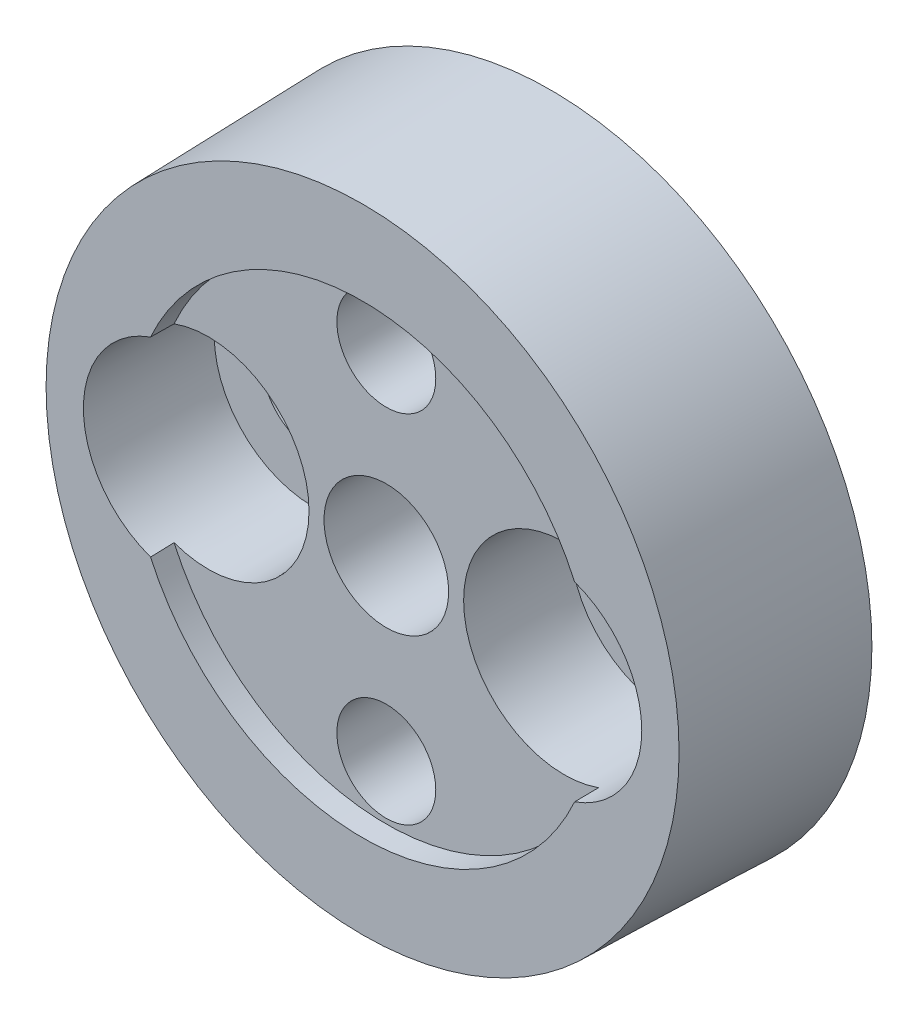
ISO-10303-21;
HEADER;
FILE_DESCRIPTION(('STEP AP214'),'2;1');
FILE_NAME('part.step','',(''),(''),'','','');
FILE_SCHEMA(('AUTOMOTIVE_DESIGN { 1 0 10303 214 1 1 1 1 }'));
ENDSEC;
DATA;
#1=APPLICATION_CONTEXT('core data for automotive mechanical design processes');
#2=APPLICATION_PROTOCOL_DEFINITION('international standard','automotive_design',2000,#1);
#3=PRODUCT_CONTEXT('',#1,'mechanical');
#4=PRODUCT('Part','Part','',(#3));
#5=PRODUCT_RELATED_PRODUCT_CATEGORY('part','',(#4));
#6=PRODUCT_DEFINITION_FORMATION('','',#4);
#7=PRODUCT_DEFINITION_CONTEXT('part definition',#1,'design');
#8=PRODUCT_DEFINITION('design','',#6,#7);
#9=PRODUCT_DEFINITION_SHAPE('','',#8);
#10=(LENGTH_UNIT() NAMED_UNIT(*) SI_UNIT(.MILLI.,.METRE.));
#11=(NAMED_UNIT(*) PLANE_ANGLE_UNIT() SI_UNIT($,.RADIAN.));
#12=(NAMED_UNIT(*) SI_UNIT($,.STERADIAN.) SOLID_ANGLE_UNIT());
#13=UNCERTAINTY_MEASURE_WITH_UNIT(LENGTH_MEASURE(1.E-05),#10,'distance_accuracy_value','');
#14=(GEOMETRIC_REPRESENTATION_CONTEXT(3) GLOBAL_UNCERTAINTY_ASSIGNED_CONTEXT((#13)) GLOBAL_UNIT_ASSIGNED_CONTEXT((#10,
#11,#12)) REPRESENTATION_CONTEXT('',''));
#15=CARTESIAN_POINT('',(0.,0.,0.));
#16=DIRECTION('',(0.,0.,1.));
#17=DIRECTION('',(1.,0.,0.));
#18=AXIS2_PLACEMENT_3D('',#15,#16,#17);
#19=CARTESIAN_POINT('',(0.,0.,9.5));
#20=DIRECTION('',(0.,0.,1.));
#21=DIRECTION('',(1.,0.,0.));
#22=AXIS2_PLACEMENT_3D('',#19,#20,#21);
#23=CYLINDRICAL_SURFACE('',#22,11.75);
#24=CARTESIAN_POINT('',(0.,0.,9.5));
#25=DIRECTION('',(0.,0.,1.));
#26=DIRECTION('',(1.,0.,0.));
#27=AXIS2_PLACEMENT_3D('',#24,#25,#26);
#28=CIRCLE('',#27,11.75);
#29=CARTESIAN_POINT('',(-10.7175026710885,-4.81639247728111,9.5));
#30=VERTEX_POINT('',#29);
#31=CARTESIAN_POINT('',(10.7175026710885,-4.8163924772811,9.5));
#32=VERTEX_POINT('',#31);
#33=EDGE_CURVE('E59',#30,#32,#28,.T.);
#34=ORIENTED_EDGE('',*,*,#33,.T.);
#35=CARTESIAN_POINT('',(10.7174411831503,-4.81652929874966,9.5062));
#36=CARTESIAN_POINT('',(10.7194451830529,-4.81207013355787,9.30413324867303));
#37=CARTESIAN_POINT('',(10.721447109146,-4.80760812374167,9.10206653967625));
#38=CARTESIAN_POINT('',(10.7254468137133,-4.79867841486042,8.69793320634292));
#39=CARTESIAN_POINT('',(10.7274445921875,-4.79421071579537,8.49586658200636));
#40=CARTESIAN_POINT('',(10.7294402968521,-4.78974017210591,8.2938));
#41=B_SPLINE_CURVE_WITH_KNOTS('',3,(#35,#36,#37,#38,#39,#40),.UNSPECIFIED.,.F.,.F.,(4,2,4),(0.,
0.606377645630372,1.21275529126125),.UNSPECIFIED.);
#42=CARTESIAN_POINT('',(10.7293790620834,-4.78987734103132,8.3));
#43=VERTEX_POINT('',#42);
#44=EDGE_CURVE('E68',#32,#43,#41,.T.);
#45=ORIENTED_EDGE('',*,*,#44,.T.);
#46=CARTESIAN_POINT('',(0.,0.,8.3));
#47=DIRECTION('',(0.,0.,1.));
#48=DIRECTION('',(1.,0.,0.));
#49=AXIS2_PLACEMENT_3D('',#46,#47,#48);
#50=CIRCLE('',#49,11.75);
#51=CARTESIAN_POINT('',(-10.7293790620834,-4.78987734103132,8.3));
#52=VERTEX_POINT('',#51);
#53=EDGE_CURVE('E58',#52,#43,#50,.T.);
#54=ORIENTED_EDGE('',*,*,#53,.F.);
#55=CARTESIAN_POINT('',(-10.7294402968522,-4.78974017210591,8.2938));
#56=CARTESIAN_POINT('',(-10.7274445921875,-4.79421071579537,8.49586658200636));
#57=CARTESIAN_POINT('',(-10.7254468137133,-4.79867841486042,8.69793320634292));
#58=CARTESIAN_POINT('',(-10.721447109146,-4.80760812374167,9.10206653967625));
#59=CARTESIAN_POINT('',(-10.7194451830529,-4.81207013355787,9.30413324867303));
#60=CARTESIAN_POINT('',(-10.7174411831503,-4.81652929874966,9.5062));
#61=B_SPLINE_CURVE_WITH_KNOTS('',3,(#55,#56,#57,#58,#59,#60),.UNSPECIFIED.,.F.,.F.,(4,2,4),(0.,
0.606377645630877,1.21275529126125),.UNSPECIFIED.);
#62=EDGE_CURVE('E115',#52,#30,#61,.T.);
#63=ORIENTED_EDGE('',*,*,#62,.T.);
#64=EDGE_LOOP('',(#34,#45,#54,#63));
#65=FACE_BOUND('',#64,.T.);
#66=ADVANCED_FACE('F14',(#65),#23,.F.);
#67=CARTESIAN_POINT('',(10.7175026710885,4.8163924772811,9.5));
#68=VERTEX_POINT('',#67);
#69=CARTESIAN_POINT('',(-10.7175026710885,4.81639247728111,9.5));
#70=VERTEX_POINT('',#69);
#71=EDGE_CURVE('E51',#68,#70,#28,.T.);
#72=ORIENTED_EDGE('',*,*,#71,.T.);
#73=CARTESIAN_POINT('',(-10.7174411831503,4.81652929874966,9.5062));
#74=CARTESIAN_POINT('',(-10.7194451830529,4.81207013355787,9.30413324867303));
#75=CARTESIAN_POINT('',(-10.721447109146,4.80760812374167,9.10206653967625));
#76=CARTESIAN_POINT('',(-10.7254468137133,4.79867841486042,8.69793320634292));
#77=CARTESIAN_POINT('',(-10.7274445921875,4.79421071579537,8.49586658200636));
#78=CARTESIAN_POINT('',(-10.7294402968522,4.78974017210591,8.2938));
#79=B_SPLINE_CURVE_WITH_KNOTS('',3,(#73,#74,#75,#76,#77,#78),.UNSPECIFIED.,.F.,.F.,(4,2,4),(0.,
0.606377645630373,1.21275529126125),.UNSPECIFIED.);
#80=CARTESIAN_POINT('',(-10.7293790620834,4.78987734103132,8.3));
#81=VERTEX_POINT('',#80);
#82=EDGE_CURVE('E29',#70,#81,#79,.T.);
#83=ORIENTED_EDGE('',*,*,#82,.T.);
#84=CARTESIAN_POINT('',(10.7293790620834,4.78987734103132,8.3));
#85=VERTEX_POINT('',#84);
#86=EDGE_CURVE('E72',#85,#81,#50,.T.);
#87=ORIENTED_EDGE('',*,*,#86,.F.);
#88=CARTESIAN_POINT('',(10.7294402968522,4.78974017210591,8.2938));
#89=CARTESIAN_POINT('',(10.7274445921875,4.79421071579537,8.49586658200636));
#90=CARTESIAN_POINT('',(10.7254468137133,4.79867841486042,8.69793320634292));
#91=CARTESIAN_POINT('',(10.721447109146,4.80760812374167,9.10206653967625));
#92=CARTESIAN_POINT('',(10.7194451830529,4.81207013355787,9.30413324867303));
#93=CARTESIAN_POINT('',(10.7174411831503,4.81652929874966,9.5062));
#94=B_SPLINE_CURVE_WITH_KNOTS('',3,(#88,#89,#90,#91,#92,#93),.UNSPECIFIED.,.F.,.F.,(4,2,4),(0.,
0.606377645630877,1.21275529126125),.UNSPECIFIED.);
#95=EDGE_CURVE('E65',#85,#68,#94,.T.);
#96=ORIENTED_EDGE('',*,*,#95,.T.);
#97=EDGE_LOOP('',(#72,#83,#87,#96));
#98=FACE_BOUND('',#97,.T.);
#99=ADVANCED_FACE('F70',(#98),#23,.F.);
#100=CARTESIAN_POINT('',(0.,16.2487662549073,0.));
#101=DIRECTION('',(0.,0.,-1.));
#102=DIRECTION('',(-1.,0.,0.));
#103=AXIS2_PLACEMENT_3D('',#100,#101,#102);
#104=PLANE('',#103);
#105=CARTESIAN_POINT('',(0.,0.,0.));
#106=DIRECTION('',(0.,0.,1.));
#107=DIRECTION('',(1.,0.,0.));
#108=AXIS2_PLACEMENT_3D('',#105,#106,#107);
#109=CIRCLE('',#108,3.15);
#110=CARTESIAN_POINT('',(3.15,0.,0.));
#111=VERTEX_POINT('',#110);
#112=EDGE_CURVE('E144',#111,#111,#109,.T.);
#113=ORIENTED_EDGE('',*,*,#112,.T.);
#114=EDGE_LOOP('',(#113));
#115=FACE_BOUND('',#114,.T.);
#116=CARTESIAN_POINT('',(0.,9.,0.));
#117=DIRECTION('',(0.,0.,1.));
#118=DIRECTION('',(1.,0.,0.));
#119=AXIS2_PLACEMENT_3D('',#116,#117,#118);
#120=CIRCLE('',#119,2.5);
#121=CARTESIAN_POINT('',(2.5,9.,0.));
#122=VERTEX_POINT('',#121);
#123=EDGE_CURVE('E131',#122,#122,#120,.T.);
#124=ORIENTED_EDGE('',*,*,#123,.T.);
#125=EDGE_LOOP('',(#124));
#126=FACE_BOUND('',#125,.T.);
#127=CARTESIAN_POINT('',(9.,0.,0.));
#128=DIRECTION('',(0.,0.,1.));
#129=DIRECTION('',(1.,0.,0.));
#130=AXIS2_PLACEMENT_3D('',#127,#128,#129);
#131=CIRCLE('',#130,2.5);
#132=CARTESIAN_POINT('',(11.5,0.,0.));
#133=VERTEX_POINT('',#132);
#134=EDGE_CURVE('E73',#133,#133,#131,.T.);
#135=ORIENTED_EDGE('',*,*,#134,.T.);
#136=EDGE_LOOP('',(#135));
#137=FACE_BOUND('',#136,.T.);
#138=CARTESIAN_POINT('',(-9.,0.,0.));
#139=DIRECTION('',(0.,0.,1.));
#140=DIRECTION('',(1.,0.,0.));
#141=AXIS2_PLACEMENT_3D('',#138,#139,#140);
#142=CIRCLE('',#141,2.5);
#143=CARTESIAN_POINT('',(-6.5,0.,0.));
#144=VERTEX_POINT('',#143);
#145=EDGE_CURVE('E191',#144,#144,#142,.T.);
#146=ORIENTED_EDGE('',*,*,#145,.T.);
#147=EDGE_LOOP('',(#146));
#148=FACE_BOUND('',#147,.T.);
#149=CARTESIAN_POINT('',(0.,-9.,0.));
#150=DIRECTION('',(0.,0.,1.));
#151=DIRECTION('',(1.,0.,0.));
#152=AXIS2_PLACEMENT_3D('',#149,#150,#151);
#153=CIRCLE('',#152,2.5);
#154=CARTESIAN_POINT('',(2.5,-9.,0.));
#155=VERTEX_POINT('',#154);
#156=EDGE_CURVE('E128',#155,#155,#153,.T.);
#157=ORIENTED_EDGE('',*,*,#156,.T.);
#158=EDGE_LOOP('',(#157));
#159=FACE_BOUND('',#158,.T.);
#160=CARTESIAN_POINT('',(0.,0.,0.));
#161=DIRECTION('',(0.,0.,1.));
#162=DIRECTION('',(1.,0.,0.));
#163=AXIS2_PLACEMENT_3D('',#160,#161,#162);
#164=CIRCLE('',#163,16.2487662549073);
#165=CARTESIAN_POINT('',(16.2487662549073,0.,0.));
#166=VERTEX_POINT('',#165);
#167=EDGE_CURVE('E134',#166,#166,#164,.T.);
#168=ORIENTED_EDGE('',*,*,#167,.F.);
#169=EDGE_LOOP('',(#168));
#170=FACE_BOUND('',#169,.T.);
#171=ADVANCED_FACE('F16',(#115,#126,#137,#148,#159,#170),#104,.T.);
#172=CARTESIAN_POINT('',(0.,0.,9.5));
#173=DIRECTION('',(0.,0.,1.));
#174=DIRECTION('',(1.,0.,0.));
#175=AXIS2_PLACEMENT_3D('',#172,#173,#174);
#176=CYLINDRICAL_SURFACE('',#175,3.15);
#177=CARTESIAN_POINT('',(0.,0.,8.3));
#178=DIRECTION('',(0.,0.,1.));
#179=DIRECTION('',(1.,0.,0.));
#180=AXIS2_PLACEMENT_3D('',#177,#178,#179);
#181=CIRCLE('',#180,3.15);
#182=CARTESIAN_POINT('',(3.15,0.,8.3));
#183=VERTEX_POINT('',#182);
#184=EDGE_CURVE('E141',#183,#183,#181,.T.);
#185=ORIENTED_EDGE('',*,*,#184,.T.);
#186=EDGE_LOOP('',(#185));
#187=FACE_BOUND('',#186,.T.);
#188=ORIENTED_EDGE('',*,*,#112,.F.);
#189=EDGE_LOOP('',(#188));
#190=FACE_BOUND('',#189,.T.);
#191=ADVANCED_FACE('F167',(#187,#190),#176,.F.);
#192=CARTESIAN_POINT('',(0.,3.15,8.3));
#193=DIRECTION('',(0.,0.,1.));
#194=DIRECTION('',(1.,0.,0.));
#195=AXIS2_PLACEMENT_3D('',#192,#193,#194);
#196=PLANE('',#195);
#197=CARTESIAN_POINT('',(9.,0.,8.3));
#198=DIRECTION('',(0.,0.,1.));
#199=DIRECTION('',(1.,0.,0.));
#200=AXIS2_PLACEMENT_3D('',#197,#198,#199);
#201=CIRCLE('',#200,5.09251184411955);
#202=EDGE_CURVE('E75',#43,#85,#201,.F.);
#203=ORIENTED_EDGE('',*,*,#202,.T.);
#204=ORIENTED_EDGE('',*,*,#86,.T.);
#205=CARTESIAN_POINT('',(-9.,0.,8.3));
#206=DIRECTION('',(0.,0.,1.));
#207=DIRECTION('',(1.,0.,0.));
#208=AXIS2_PLACEMENT_3D('',#205,#206,#207);
#209=CIRCLE('',#208,5.09251184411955);
#210=EDGE_CURVE('E34',#81,#52,#209,.F.);
#211=ORIENTED_EDGE('',*,*,#210,.T.);
#212=ORIENTED_EDGE('',*,*,#53,.T.);
#213=EDGE_LOOP('',(#203,#204,#211,#212));
#214=FACE_BOUND('',#213,.T.);
#215=CARTESIAN_POINT('',(0.,9.,8.3));
#216=DIRECTION('',(0.,0.,1.));
#217=DIRECTION('',(1.,0.,0.));
#218=AXIS2_PLACEMENT_3D('',#215,#216,#217);
#219=CIRCLE('',#218,2.5);
#220=CARTESIAN_POINT('',(2.5,9.,8.3));
#221=VERTEX_POINT('',#220);
#222=EDGE_CURVE('E147',#221,#221,#219,.F.);
#223=ORIENTED_EDGE('',*,*,#222,.T.);
#224=EDGE_LOOP('',(#223));
#225=FACE_BOUND('',#224,.T.);
#226=CARTESIAN_POINT('',(0.,-9.,8.3));
#227=DIRECTION('',(0.,0.,1.));
#228=DIRECTION('',(1.,0.,0.));
#229=AXIS2_PLACEMENT_3D('',#226,#227,#228);
#230=CIRCLE('',#229,2.5);
#231=CARTESIAN_POINT('',(2.5,-9.,8.3));
#232=VERTEX_POINT('',#231);
#233=EDGE_CURVE('E150',#232,#232,#230,.F.);
#234=ORIENTED_EDGE('',*,*,#233,.T.);
#235=EDGE_LOOP('',(#234));
#236=FACE_BOUND('',#235,.T.);
#237=ORIENTED_EDGE('',*,*,#184,.F.);
#238=EDGE_LOOP('',(#237));
#239=FACE_BOUND('',#238,.T.);
#240=ADVANCED_FACE('F154',(#214,#225,#236,#239),#196,.T.);
#241=CARTESIAN_POINT('',(0.,11.75,9.5));
#242=DIRECTION('',(0.,0.,1.));
#243=DIRECTION('',(1.,0.,0.));
#244=AXIS2_PLACEMENT_3D('',#241,#242,#243);
#245=PLANE('',#244);
#246=CARTESIAN_POINT('',(0.,0.,9.5));
#247=DIRECTION('',(0.,0.,1.));
#248=DIRECTION('',(1.,0.,0.));
#249=AXIS2_PLACEMENT_3D('',#246,#247,#248);
#250=CIRCLE('',#249,16.);
#251=CARTESIAN_POINT('',(16.,0.,9.5));
#252=VERTEX_POINT('',#251);
#253=EDGE_CURVE('E137',#252,#252,#250,.T.);
#254=ORIENTED_EDGE('',*,*,#253,.T.);
#255=EDGE_LOOP('',(#254));
#256=FACE_BOUND('',#255,.T.);
#257=CARTESIAN_POINT('',(9.,0.,9.5));
#258=DIRECTION('',(0.,0.,1.));
#259=DIRECTION('',(1.,0.,0.));
#260=AXIS2_PLACEMENT_3D('',#257,#258,#259);
#261=CIRCLE('',#260,5.11345792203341);
#262=EDGE_CURVE('E9',#68,#32,#261,.F.);
#263=ORIENTED_EDGE('',*,*,#262,.T.);
#264=ORIENTED_EDGE('',*,*,#33,.F.);
#265=CARTESIAN_POINT('',(-9.,0.,9.5));
#266=DIRECTION('',(0.,0.,1.));
#267=DIRECTION('',(1.,0.,0.));
#268=AXIS2_PLACEMENT_3D('',#265,#266,#267);
#269=CIRCLE('',#268,5.11345792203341);
#270=EDGE_CURVE('E22',#30,#70,#269,.F.);
#271=ORIENTED_EDGE('',*,*,#270,.T.);
#272=ORIENTED_EDGE('',*,*,#71,.F.);
#273=EDGE_LOOP('',(#263,#264,#271,#272));
#274=FACE_BOUND('',#273,.T.);
#275=ADVANCED_FACE('F53',(#256,#274),#245,.T.);
#276=CARTESIAN_POINT('',(0.,0.,9.5));
#277=DIRECTION('',(0.,0.,-1.));
#278=DIRECTION('',(-1.,0.,0.));
#279=AXIS2_PLACEMENT_3D('',#276,#277,#278);
#280=CONICAL_SURFACE('',#279,16.,0.0261799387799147);
#281=ORIENTED_EDGE('',*,*,#167,.T.);
#282=EDGE_LOOP('',(#281));
#283=FACE_BOUND('',#282,.T.);
#284=ORIENTED_EDGE('',*,*,#253,.F.);
#285=EDGE_LOOP('',(#284));
#286=FACE_BOUND('',#285,.T.);
#287=ADVANCED_FACE('F171',(#283,#286),#280,.T.);
#288=CARTESIAN_POINT('',(0.,9.,18.));
#289=DIRECTION('',(0.,0.,1.));
#290=DIRECTION('',(1.,0.,0.));
#291=AXIS2_PLACEMENT_3D('',#288,#289,#290);
#292=CYLINDRICAL_SURFACE('',#291,2.5);
#293=ORIENTED_EDGE('',*,*,#222,.F.);
#294=EDGE_LOOP('',(#293));
#295=FACE_BOUND('',#294,.T.);
#296=ORIENTED_EDGE('',*,*,#123,.F.);
#297=EDGE_LOOP('',(#296));
#298=FACE_BOUND('',#297,.T.);
#299=ADVANCED_FACE('F161',(#295,#298),#292,.F.);
#300=CARTESIAN_POINT('',(0.,-9.,18.));
#301=DIRECTION('',(0.,0.,1.));
#302=DIRECTION('',(1.,0.,0.));
#303=AXIS2_PLACEMENT_3D('',#300,#301,#302);
#304=CYLINDRICAL_SURFACE('',#303,2.5);
#305=ORIENTED_EDGE('',*,*,#233,.F.);
#306=EDGE_LOOP('',(#305));
#307=FACE_BOUND('',#306,.T.);
#308=ORIENTED_EDGE('',*,*,#156,.F.);
#309=EDGE_LOOP('',(#308));
#310=FACE_BOUND('',#309,.T.);
#311=ADVANCED_FACE('F157',(#307,#310),#304,.F.);
#312=CARTESIAN_POINT('',(-9.,0.,0.));
#313=DIRECTION('',(0.,0.,1.));
#314=DIRECTION('',(1.,0.,0.));
#315=AXIS2_PLACEMENT_3D('',#312,#313,#314);
#316=CONICAL_SURFACE('',#315,2.5,0.026179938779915);
#317=CARTESIAN_POINT('',(-9.,0.,3.));
#318=DIRECTION('',(0.,0.,1.));
#319=DIRECTION('',(1.,0.,0.));
#320=AXIS2_PLACEMENT_3D('',#317,#318,#319);
#321=CIRCLE('',#320,2.57855776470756);
#322=CARTESIAN_POINT('',(-6.42144223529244,0.,3.));
#323=VERTEX_POINT('',#322);
#324=EDGE_CURVE('E193',#323,#323,#321,.T.);
#325=ORIENTED_EDGE('',*,*,#324,.T.);
#326=EDGE_LOOP('',(#325));
#327=FACE_BOUND('',#326,.T.);
#328=ORIENTED_EDGE('',*,*,#145,.F.);
#329=EDGE_LOOP('',(#328));
#330=FACE_BOUND('',#329,.T.);
#331=ADVANCED_FACE('F160',(#327,#330),#316,.F.);
#332=CARTESIAN_POINT('',(-6.42144223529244,0.,3.));
#333=DIRECTION('',(0.,0.,1.));
#334=DIRECTION('',(1.,0.,0.));
#335=AXIS2_PLACEMENT_3D('',#332,#333,#334);
#336=PLANE('',#335);
#337=CARTESIAN_POINT('',(-9.,0.,3.));
#338=DIRECTION('',(0.,0.,1.));
#339=DIRECTION('',(1.,0.,0.));
#340=AXIS2_PLACEMENT_3D('',#337,#338,#339);
#341=CIRCLE('',#340,5.);
#342=CARTESIAN_POINT('',(-4.,0.,3.));
#343=VERTEX_POINT('',#342);
#344=EDGE_CURVE('E197',#343,#343,#341,.T.);
#345=ORIENTED_EDGE('',*,*,#344,.T.);
#346=EDGE_LOOP('',(#345));
#347=FACE_BOUND('',#346,.T.);
#348=ORIENTED_EDGE('',*,*,#324,.F.);
#349=EDGE_LOOP('',(#348));
#350=FACE_BOUND('',#349,.T.);
#351=ADVANCED_FACE('F111',(#347,#350),#336,.T.);
#352=CARTESIAN_POINT('',(-9.,0.,3.));
#353=DIRECTION('',(0.,0.,1.));
#354=DIRECTION('',(1.,0.,0.));
#355=AXIS2_PLACEMENT_3D('',#352,#353,#354);
#356=CONICAL_SURFACE('',#355,5.,0.0174532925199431);
#357=ORIENTED_EDGE('',*,*,#210,.F.);
#358=ORIENTED_EDGE('',*,*,#82,.F.);
#359=ORIENTED_EDGE('',*,*,#270,.F.);
#360=ORIENTED_EDGE('',*,*,#62,.F.);
#361=EDGE_LOOP('',(#357,#358,#359,#360));
#362=FACE_BOUND('',#361,.T.);
#363=ORIENTED_EDGE('',*,*,#344,.F.);
#364=EDGE_LOOP('',(#363));
#365=FACE_BOUND('',#364,.T.);
#366=ADVANCED_FACE('F106',(#362,#365),#356,.F.);
#367=CARTESIAN_POINT('',(9.,0.,0.));
#368=DIRECTION('',(0.,0.,1.));
#369=DIRECTION('',(1.,0.,0.));
#370=AXIS2_PLACEMENT_3D('',#367,#368,#369);
#371=CONICAL_SURFACE('',#370,2.5,0.026179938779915);
#372=CARTESIAN_POINT('',(9.,0.,3.));
#373=DIRECTION('',(0.,0.,1.));
#374=DIRECTION('',(1.,0.,0.));
#375=AXIS2_PLACEMENT_3D('',#372,#373,#374);
#376=CIRCLE('',#375,2.57855776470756);
#377=CARTESIAN_POINT('',(11.5785577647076,0.,3.));
#378=VERTEX_POINT('',#377);
#379=EDGE_CURVE('E78',#378,#378,#376,.T.);
#380=ORIENTED_EDGE('',*,*,#379,.T.);
#381=EDGE_LOOP('',(#380));
#382=FACE_BOUND('',#381,.T.);
#383=ORIENTED_EDGE('',*,*,#134,.F.);
#384=EDGE_LOOP('',(#383));
#385=FACE_BOUND('',#384,.T.);
#386=ADVANCED_FACE('F102',(#382,#385),#371,.F.);
#387=CARTESIAN_POINT('',(11.5785577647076,0.,3.));
#388=DIRECTION('',(0.,0.,1.));
#389=DIRECTION('',(1.,0.,0.));
#390=AXIS2_PLACEMENT_3D('',#387,#388,#389);
#391=PLANE('',#390);
#392=CARTESIAN_POINT('',(9.,0.,3.));
#393=DIRECTION('',(0.,0.,1.));
#394=DIRECTION('',(1.,0.,0.));
#395=AXIS2_PLACEMENT_3D('',#392,#393,#394);
#396=CIRCLE('',#395,5.);
#397=CARTESIAN_POINT('',(14.,0.,3.));
#398=VERTEX_POINT('',#397);
#399=EDGE_CURVE('E322',#398,#398,#396,.T.);
#400=ORIENTED_EDGE('',*,*,#399,.T.);
#401=EDGE_LOOP('',(#400));
#402=FACE_BOUND('',#401,.T.);
#403=ORIENTED_EDGE('',*,*,#379,.F.);
#404=EDGE_LOOP('',(#403));
#405=FACE_BOUND('',#404,.T.);
#406=ADVANCED_FACE('F98',(#402,#405),#391,.T.);
#407=CARTESIAN_POINT('',(9.,0.,3.));
#408=DIRECTION('',(0.,0.,1.));
#409=DIRECTION('',(1.,0.,0.));
#410=AXIS2_PLACEMENT_3D('',#407,#408,#409);
#411=CONICAL_SURFACE('',#410,5.,0.0174532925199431);
#412=ORIENTED_EDGE('',*,*,#44,.F.);
#413=ORIENTED_EDGE('',*,*,#262,.F.);
#414=ORIENTED_EDGE('',*,*,#95,.F.);
#415=ORIENTED_EDGE('',*,*,#202,.F.);
#416=EDGE_LOOP('',(#412,#413,#414,#415));
#417=FACE_BOUND('',#416,.T.);
#418=ORIENTED_EDGE('',*,*,#399,.F.);
#419=EDGE_LOOP('',(#418));
#420=FACE_BOUND('',#419,.T.);
#421=ADVANCED_FACE('F63',(#417,#420),#411,.F.);
#422=CLOSED_SHELL('',(#66,#99,#171,#191,#240,#275,#287,#299,#311,#331,#351,#366,#386,#406,#421));
#423=MANIFOLD_SOLID_BREP('B1',#422);
#424=ADVANCED_BREP_SHAPE_REPRESENTATION('',(#18,#423),#14);
#425=SHAPE_DEFINITION_REPRESENTATION(#9,#424);
ENDSEC;
END-ISO-10303-21;
